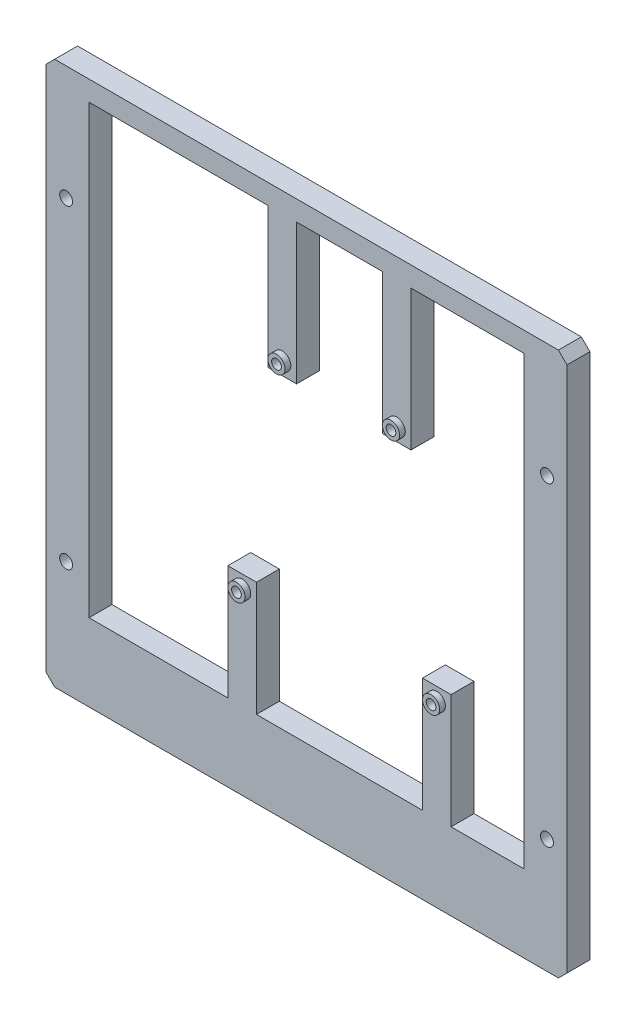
ISO-10303-21;
HEADER;
FILE_DESCRIPTION(('STEP AP214'),'2;1');
FILE_NAME('part.step','',(''),(''),'','','');
FILE_SCHEMA(('AUTOMOTIVE_DESIGN { 1 0 10303 214 1 1 1 1 }'));
ENDSEC;
DATA;
#1=APPLICATION_CONTEXT('core data for automotive mechanical design processes');
#2=APPLICATION_PROTOCOL_DEFINITION('international standard','automotive_design',2000,#1);
#3=PRODUCT_CONTEXT('',#1,'mechanical');
#4=PRODUCT('Part','Part','',(#3));
#5=PRODUCT_RELATED_PRODUCT_CATEGORY('part','',(#4));
#6=PRODUCT_DEFINITION_FORMATION('','',#4);
#7=PRODUCT_DEFINITION_CONTEXT('part definition',#1,'design');
#8=PRODUCT_DEFINITION('design','',#6,#7);
#9=PRODUCT_DEFINITION_SHAPE('','',#8);
#10=(LENGTH_UNIT() NAMED_UNIT(*) SI_UNIT(.MILLI.,.METRE.));
#11=(NAMED_UNIT(*) PLANE_ANGLE_UNIT() SI_UNIT($,.RADIAN.));
#12=(NAMED_UNIT(*) SI_UNIT($,.STERADIAN.) SOLID_ANGLE_UNIT());
#13=UNCERTAINTY_MEASURE_WITH_UNIT(LENGTH_MEASURE(1.E-05),#10,'distance_accuracy_value','');
#14=(GEOMETRIC_REPRESENTATION_CONTEXT(3) GLOBAL_UNCERTAINTY_ASSIGNED_CONTEXT((#13)) GLOBAL_UNIT_ASSIGNED_CONTEXT((#10,
#11,#12)) REPRESENTATION_CONTEXT('',''));
#15=CARTESIAN_POINT('',(0.,0.,0.));
#16=DIRECTION('',(0.,0.,1.));
#17=DIRECTION('',(1.,0.,0.));
#18=AXIS2_PLACEMENT_3D('',#15,#16,#17);
#19=CARTESIAN_POINT('',(0.,0.,8.));
#20=DIRECTION('',(0.,0.,1.));
#21=DIRECTION('',(1.,0.,0.));
#22=AXIS2_PLACEMENT_3D('',#19,#20,#21);
#23=PLANE('',#22);
#24=CARTESIAN_POINT('',(35.5,-32.5,8.));
#25=DIRECTION('',(0.,0.,1.));
#26=DIRECTION('',(1.,0.,0.));
#27=AXIS2_PLACEMENT_3D('',#24,#25,#26);
#28=CIRCLE('',#27,3.);
#29=CARTESIAN_POINT('',(38.5,-32.5,8.));
#30=VERTEX_POINT('',#29);
#31=EDGE_CURVE('E607',#30,#30,#28,.T.);
#32=ORIENTED_EDGE('',*,*,#31,.F.);
#33=EDGE_LOOP('',(#32));
#34=FACE_BOUND('',#33,.T.);
#35=CARTESIAN_POINT('',(-18.5,43.5,8.));
#36=DIRECTION('',(0.,0.,1.));
#37=DIRECTION('',(1.,0.,0.));
#38=AXIS2_PLACEMENT_3D('',#35,#36,#37);
#39=CIRCLE('',#38,3.);
#40=CARTESIAN_POINT('',(-15.5,43.5,8.));
#41=VERTEX_POINT('',#40);
#42=EDGE_CURVE('E623',#41,#41,#39,.T.);
#43=ORIENTED_EDGE('',*,*,#42,.F.);
#44=EDGE_LOOP('',(#43));
#45=FACE_BOUND('',#44,.T.);
#46=DIRECTION('',(-1.,0.,0.));
#47=VECTOR('',#46,1.);
#48=CARTESIAN_POINT('',(66.,88.,8.));
#49=LINE('',#48,#47);
#50=CARTESIAN_POINT('',(-23.5,88.,8.));
#51=VERTEX_POINT('',#50);
#52=CARTESIAN_POINT('',(-86.,88.,8.));
#53=VERTEX_POINT('',#52);
#54=EDGE_CURVE('E236',#51,#53,#49,.T.);
#55=ORIENTED_EDGE('',*,*,#54,.F.);
#56=DIRECTION('',(0.,-1.,0.));
#57=VECTOR('',#56,1.);
#58=CARTESIAN_POINT('',(-23.5,92.,8.));
#59=LINE('',#58,#57);
#60=CARTESIAN_POINT('',(-23.5,39.,8.));
#61=VERTEX_POINT('',#60);
#62=EDGE_CURVE('E229',#51,#61,#59,.T.);
#63=ORIENTED_EDGE('',*,*,#62,.T.);
#64=DIRECTION('',(1.,0.,0.));
#65=VECTOR('',#64,1.);
#66=CARTESIAN_POINT('',(-23.5,39.,8.));
#67=LINE('',#66,#65);
#68=CARTESIAN_POINT('',(-13.5,39.,8.));
#69=VERTEX_POINT('',#68);
#70=EDGE_CURVE('E233',#61,#69,#67,.T.);
#71=ORIENTED_EDGE('',*,*,#70,.T.);
#72=DIRECTION('',(0.,1.,0.));
#73=VECTOR('',#72,1.);
#74=CARTESIAN_POINT('',(-13.5,39.,8.));
#75=LINE('',#74,#73);
#76=CARTESIAN_POINT('',(-13.5,88.,8.));
#77=VERTEX_POINT('',#76);
#78=EDGE_CURVE('E247',#69,#77,#75,.T.);
#79=ORIENTED_EDGE('',*,*,#78,.T.);
#80=CARTESIAN_POINT('',(16.5,88.,8.));
#81=VERTEX_POINT('',#80);
#82=EDGE_CURVE('E371',#81,#77,#49,.T.);
#83=ORIENTED_EDGE('',*,*,#82,.F.);
#84=DIRECTION('',(0.,-1.,0.));
#85=VECTOR('',#84,1.);
#86=CARTESIAN_POINT('',(16.5,92.,8.));
#87=LINE('',#86,#85);
#88=CARTESIAN_POINT('',(16.5,39.,8.));
#89=VERTEX_POINT('',#88);
#90=EDGE_CURVE('E265',#81,#89,#87,.T.);
#91=ORIENTED_EDGE('',*,*,#90,.T.);
#92=DIRECTION('',(1.,0.,0.));
#93=VECTOR('',#92,1.);
#94=CARTESIAN_POINT('',(16.5,39.,8.));
#95=LINE('',#94,#93);
#96=CARTESIAN_POINT('',(26.5,39.,8.));
#97=VERTEX_POINT('',#96);
#98=EDGE_CURVE('E267',#89,#97,#95,.T.);
#99=ORIENTED_EDGE('',*,*,#98,.T.);
#100=DIRECTION('',(0.,1.,0.));
#101=VECTOR('',#100,1.);
#102=CARTESIAN_POINT('',(26.5,39.,8.));
#103=LINE('',#102,#101);
#104=CARTESIAN_POINT('',(26.5,88.,8.));
#105=VERTEX_POINT('',#104);
#106=EDGE_CURVE('E269',#97,#105,#103,.T.);
#107=ORIENTED_EDGE('',*,*,#106,.T.);
#108=CARTESIAN_POINT('',(66.,88.,8.));
#109=VERTEX_POINT('',#108);
#110=EDGE_CURVE('E367',#109,#105,#49,.T.);
#111=ORIENTED_EDGE('',*,*,#110,.F.);
#112=DIRECTION('',(0.,1.,0.));
#113=VECTOR('',#112,1.);
#114=CARTESIAN_POINT('',(66.,-68.,8.));
#115=LINE('',#114,#113);
#116=CARTESIAN_POINT('',(66.,-68.,8.));
#117=VERTEX_POINT('',#116);
#118=EDGE_CURVE('E363',#117,#109,#115,.T.);
#119=ORIENTED_EDGE('',*,*,#118,.F.);
#120=DIRECTION('',(1.,0.,0.));
#121=VECTOR('',#120,1.);
#122=CARTESIAN_POINT('',(-86.,-68.,8.));
#123=LINE('',#122,#121);
#124=CARTESIAN_POINT('',(40.5,-68.,8.));
#125=VERTEX_POINT('',#124);
#126=EDGE_CURVE('E358',#125,#117,#123,.T.);
#127=ORIENTED_EDGE('',*,*,#126,.F.);
#128=DIRECTION('',(0.,1.,0.));
#129=VECTOR('',#128,1.);
#130=CARTESIAN_POINT('',(40.5,-92.,8.));
#131=LINE('',#130,#129);
#132=CARTESIAN_POINT('',(40.5,-28.,8.));
#133=VERTEX_POINT('',#132);
#134=EDGE_CURVE('E288',#125,#133,#131,.T.);
#135=ORIENTED_EDGE('',*,*,#134,.T.);
#136=DIRECTION('',(-1.,0.,0.));
#137=VECTOR('',#136,1.);
#138=CARTESIAN_POINT('',(40.5,-28.,8.));
#139=LINE('',#138,#137);
#140=CARTESIAN_POINT('',(30.5,-28.,8.));
#141=VERTEX_POINT('',#140);
#142=EDGE_CURVE('E291',#133,#141,#139,.T.);
#143=ORIENTED_EDGE('',*,*,#142,.T.);
#144=DIRECTION('',(0.,-1.,0.));
#145=VECTOR('',#144,1.);
#146=CARTESIAN_POINT('',(30.5,-28.,8.));
#147=LINE('',#146,#145);
#148=CARTESIAN_POINT('',(30.5,-68.,8.));
#149=VERTEX_POINT('',#148);
#150=EDGE_CURVE('E285',#141,#149,#147,.T.);
#151=ORIENTED_EDGE('',*,*,#150,.T.);
#152=CARTESIAN_POINT('',(-27.5,-68.,8.));
#153=VERTEX_POINT('',#152);
#154=EDGE_CURVE('E364',#153,#149,#123,.T.);
#155=ORIENTED_EDGE('',*,*,#154,.F.);
#156=DIRECTION('',(0.,1.,0.));
#157=VECTOR('',#156,1.);
#158=CARTESIAN_POINT('',(-27.5,-92.,8.));
#159=LINE('',#158,#157);
#160=CARTESIAN_POINT('',(-27.5,-28.,8.));
#161=VERTEX_POINT('',#160);
#162=EDGE_CURVE('E316',#153,#161,#159,.T.);
#163=ORIENTED_EDGE('',*,*,#162,.T.);
#164=DIRECTION('',(-1.,0.,0.));
#165=VECTOR('',#164,1.);
#166=CARTESIAN_POINT('',(-27.5,-28.,8.));
#167=LINE('',#166,#165);
#168=CARTESIAN_POINT('',(-37.5,-28.,8.));
#169=VERTEX_POINT('',#168);
#170=EDGE_CURVE('E319',#161,#169,#167,.T.);
#171=ORIENTED_EDGE('',*,*,#170,.T.);
#172=DIRECTION('',(0.,-1.,0.));
#173=VECTOR('',#172,1.);
#174=CARTESIAN_POINT('',(-37.5,-28.,8.));
#175=LINE('',#174,#173);
#176=CARTESIAN_POINT('',(-37.5,-68.,8.));
#177=VERTEX_POINT('',#176);
#178=EDGE_CURVE('E313',#169,#177,#175,.T.);
#179=ORIENTED_EDGE('',*,*,#178,.T.);
#180=CARTESIAN_POINT('',(-86.,-68.,8.));
#181=VERTEX_POINT('',#180);
#182=EDGE_CURVE('E360',#181,#177,#123,.T.);
#183=ORIENTED_EDGE('',*,*,#182,.F.);
#184=DIRECTION('',(0.,-1.,0.));
#185=VECTOR('',#184,1.);
#186=CARTESIAN_POINT('',(-86.,88.,8.));
#187=LINE('',#186,#185);
#188=EDGE_CURVE('E356',#53,#181,#187,.T.);
#189=ORIENTED_EDGE('',*,*,#188,.F.);
#190=EDGE_LOOP('',(#55,#63,#71,#79,#83,#91,#99,#107,#111,#119,#127,#135,#143,#151,#155,#163,
#171,#179,#183,#189));
#191=FACE_BOUND('',#190,.T.);
#192=CARTESIAN_POINT('',(74.,-55.,8.));
#193=DIRECTION('',(0.,0.,1.));
#194=DIRECTION('',(1.,0.,0.));
#195=AXIS2_PLACEMENT_3D('',#192,#193,#194);
#196=CIRCLE('',#195,2.25);
#197=CARTESIAN_POINT('',(76.25,-55.,8.));
#198=VERTEX_POINT('',#197);
#199=EDGE_CURVE('E338',#198,#198,#196,.T.);
#200=ORIENTED_EDGE('',*,*,#199,.F.);
#201=EDGE_LOOP('',(#200));
#202=FACE_BOUND('',#201,.T.);
#203=CARTESIAN_POINT('',(-94.,-55.,8.));
#204=DIRECTION('',(0.,0.,1.));
#205=DIRECTION('',(1.,0.,0.));
#206=AXIS2_PLACEMENT_3D('',#203,#204,#205);
#207=CIRCLE('',#206,2.25);
#208=CARTESIAN_POINT('',(-91.75,-55.,8.));
#209=VERTEX_POINT('',#208);
#210=EDGE_CURVE('E350',#209,#209,#207,.T.);
#211=ORIENTED_EDGE('',*,*,#210,.F.);
#212=EDGE_LOOP('',(#211));
#213=FACE_BOUND('',#212,.T.);
#214=DIRECTION('',(0.707106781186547,-0.707106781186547,0.));
#215=VECTOR('',#214,1.);
#216=CARTESIAN_POINT('',(-101.,-92.,8.));
#217=LINE('',#216,#215);
#218=CARTESIAN_POINT('',(-101.,-92.,8.));
#219=VERTEX_POINT('',#218);
#220=CARTESIAN_POINT('',(-98.,-95.,8.));
#221=VERTEX_POINT('',#220);
#222=EDGE_CURVE('E397',#219,#221,#217,.T.);
#223=ORIENTED_EDGE('',*,*,#222,.T.);
#224=DIRECTION('',(1.,0.,0.));
#225=VECTOR('',#224,1.);
#226=CARTESIAN_POINT('',(-98.,-95.,8.));
#227=LINE('',#226,#225);
#228=CARTESIAN_POINT('',(78.,-95.,8.));
#229=VERTEX_POINT('',#228);
#230=EDGE_CURVE('E400',#221,#229,#227,.T.);
#231=ORIENTED_EDGE('',*,*,#230,.T.);
#232=DIRECTION('',(0.707106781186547,0.707106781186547,0.));
#233=VECTOR('',#232,1.);
#234=CARTESIAN_POINT('',(78.,-95.,8.));
#235=LINE('',#234,#233);
#236=CARTESIAN_POINT('',(81.,-92.,8.));
#237=VERTEX_POINT('',#236);
#238=EDGE_CURVE('E403',#229,#237,#235,.T.);
#239=ORIENTED_EDGE('',*,*,#238,.T.);
#240=DIRECTION('',(0.,1.,0.));
#241=VECTOR('',#240,1.);
#242=CARTESIAN_POINT('',(81.,-92.,8.));
#243=LINE('',#242,#241);
#244=CARTESIAN_POINT('',(81.,92.,8.));
#245=VERTEX_POINT('',#244);
#246=EDGE_CURVE('E405',#237,#245,#243,.T.);
#247=ORIENTED_EDGE('',*,*,#246,.T.);
#248=DIRECTION('',(-0.707106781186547,0.707106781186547,0.));
#249=VECTOR('',#248,1.);
#250=CARTESIAN_POINT('',(81.,92.,8.));
#251=LINE('',#250,#249);
#252=CARTESIAN_POINT('',(78.,95.,8.));
#253=VERTEX_POINT('',#252);
#254=EDGE_CURVE('E407',#245,#253,#251,.T.);
#255=ORIENTED_EDGE('',*,*,#254,.T.);
#256=DIRECTION('',(-1.,0.,0.));
#257=VECTOR('',#256,1.);
#258=CARTESIAN_POINT('',(78.,95.,8.));
#259=LINE('',#258,#257);
#260=CARTESIAN_POINT('',(-98.,95.,8.));
#261=VERTEX_POINT('',#260);
#262=EDGE_CURVE('E409',#253,#261,#259,.T.);
#263=ORIENTED_EDGE('',*,*,#262,.T.);
#264=DIRECTION('',(-0.707106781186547,-0.707106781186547,0.));
#265=VECTOR('',#264,1.);
#266=CARTESIAN_POINT('',(-98.,95.,8.));
#267=LINE('',#266,#265);
#268=CARTESIAN_POINT('',(-101.,92.,8.));
#269=VERTEX_POINT('',#268);
#270=EDGE_CURVE('E411',#261,#269,#267,.T.);
#271=ORIENTED_EDGE('',*,*,#270,.T.);
#272=DIRECTION('',(0.,-1.,0.));
#273=VECTOR('',#272,1.);
#274=CARTESIAN_POINT('',(-101.,92.,8.));
#275=LINE('',#274,#273);
#276=EDGE_CURVE('E413',#269,#219,#275,.T.);
#277=ORIENTED_EDGE('',*,*,#276,.T.);
#278=EDGE_LOOP('',(#223,#231,#239,#247,#255,#263,#271,#277));
#279=FACE_BOUND('',#278,.T.);
#280=CARTESIAN_POINT('',(-94.,55.,8.));
#281=DIRECTION('',(0.,0.,1.));
#282=DIRECTION('',(1.,0.,0.));
#283=AXIS2_PLACEMENT_3D('',#280,#281,#282);
#284=CIRCLE('',#283,2.25);
#285=CARTESIAN_POINT('',(-91.75,55.,8.));
#286=VERTEX_POINT('',#285);
#287=EDGE_CURVE('E344',#286,#286,#284,.T.);
#288=ORIENTED_EDGE('',*,*,#287,.F.);
#289=EDGE_LOOP('',(#288));
#290=FACE_BOUND('',#289,.T.);
#291=CARTESIAN_POINT('',(74.,55.,8.));
#292=DIRECTION('',(0.,0.,1.));
#293=DIRECTION('',(1.,0.,0.));
#294=AXIS2_PLACEMENT_3D('',#291,#292,#293);
#295=CIRCLE('',#294,2.25);
#296=CARTESIAN_POINT('',(76.25,55.,8.));
#297=VERTEX_POINT('',#296);
#298=EDGE_CURVE('E332',#297,#297,#295,.T.);
#299=ORIENTED_EDGE('',*,*,#298,.F.);
#300=EDGE_LOOP('',(#299));
#301=FACE_BOUND('',#300,.T.);
#302=CARTESIAN_POINT('',(21.5,43.5,8.));
#303=DIRECTION('',(0.,0.,1.));
#304=DIRECTION('',(1.,0.,0.));
#305=AXIS2_PLACEMENT_3D('',#302,#303,#304);
#306=CIRCLE('',#305,3.);
#307=CARTESIAN_POINT('',(24.5,43.5,8.));
#308=VERTEX_POINT('',#307);
#309=EDGE_CURVE('E593',#308,#308,#306,.T.);
#310=ORIENTED_EDGE('',*,*,#309,.F.);
#311=EDGE_LOOP('',(#310));
#312=FACE_BOUND('',#311,.T.);
#313=CARTESIAN_POINT('',(-32.5,-32.5,8.));
#314=DIRECTION('',(0.,0.,1.));
#315=DIRECTION('',(1.,0.,0.));
#316=AXIS2_PLACEMENT_3D('',#313,#314,#315);
#317=CIRCLE('',#316,3.);
#318=CARTESIAN_POINT('',(-29.5,-32.5,8.));
#319=VERTEX_POINT('',#318);
#320=EDGE_CURVE('E596',#319,#319,#317,.T.);
#321=ORIENTED_EDGE('',*,*,#320,.F.);
#322=EDGE_LOOP('',(#321));
#323=FACE_BOUND('',#322,.T.);
#324=ADVANCED_FACE('F43',(#34,#45,#191,#202,#213,#279,#290,#301,#312,#323),#23,.T.);
#325=CARTESIAN_POINT('',(66.,88.,8.));
#326=DIRECTION('',(0.,-1.,0.));
#327=DIRECTION('',(0.,0.,-1.));
#328=AXIS2_PLACEMENT_3D('',#325,#326,#327);
#329=PLANE('',#328);
#330=DIRECTION('',(-1.,0.,0.));
#331=VECTOR('',#330,1.);
#332=CARTESIAN_POINT('',(66.,88.,0.));
#333=LINE('',#332,#331);
#334=CARTESIAN_POINT('',(-23.5,88.,0.));
#335=VERTEX_POINT('',#334);
#336=CARTESIAN_POINT('',(-86.,88.,0.));
#337=VERTEX_POINT('',#336);
#338=EDGE_CURVE('E382',#335,#337,#333,.T.);
#339=ORIENTED_EDGE('',*,*,#338,.F.);
#340=DIRECTION('',(0.,0.,1.));
#341=VECTOR('',#340,1.);
#342=CARTESIAN_POINT('',(-23.5,88.,8.));
#343=LINE('',#342,#341);
#344=EDGE_CURVE('E255',#335,#51,#343,.T.);
#345=ORIENTED_EDGE('',*,*,#344,.T.);
#346=ORIENTED_EDGE('',*,*,#54,.T.);
#347=DIRECTION('',(0.,0.,-1.));
#348=VECTOR('',#347,1.);
#349=CARTESIAN_POINT('',(-86.,88.,8.));
#350=LINE('',#349,#348);
#351=EDGE_CURVE('E370',#53,#337,#350,.T.);
#352=ORIENTED_EDGE('',*,*,#351,.T.);
#353=EDGE_LOOP('',(#339,#345,#346,#352));
#354=FACE_BOUND('',#353,.T.);
#355=ADVANCED_FACE('F497',(#354),#329,.T.);
#356=ORIENTED_EDGE('',*,*,#82,.T.);
#357=DIRECTION('',(0.,0.,-1.));
#358=VECTOR('',#357,1.);
#359=CARTESIAN_POINT('',(-13.5,88.,8.));
#360=LINE('',#359,#358);
#361=CARTESIAN_POINT('',(-13.5,88.,0.));
#362=VERTEX_POINT('',#361);
#363=EDGE_CURVE('E253',#77,#362,#360,.T.);
#364=ORIENTED_EDGE('',*,*,#363,.T.);
#365=CARTESIAN_POINT('',(16.5,88.,0.));
#366=VERTEX_POINT('',#365);
#367=EDGE_CURVE('E385',#366,#362,#333,.T.);
#368=ORIENTED_EDGE('',*,*,#367,.F.);
#369=DIRECTION('',(0.,0.,1.));
#370=VECTOR('',#369,1.);
#371=CARTESIAN_POINT('',(16.5,88.,8.));
#372=LINE('',#371,#370);
#373=EDGE_CURVE('E11',#366,#81,#372,.T.);
#374=ORIENTED_EDGE('',*,*,#373,.T.);
#375=EDGE_LOOP('',(#356,#364,#368,#374));
#376=FACE_BOUND('',#375,.T.);
#377=ADVANCED_FACE('F488',(#376),#329,.T.);
#378=ORIENTED_EDGE('',*,*,#110,.T.);
#379=DIRECTION('',(0.,0.,-1.));
#380=VECTOR('',#379,1.);
#381=CARTESIAN_POINT('',(26.5,88.,8.));
#382=LINE('',#381,#380);
#383=CARTESIAN_POINT('',(26.5,88.,0.));
#384=VERTEX_POINT('',#383);
#385=EDGE_CURVE('E51',#105,#384,#382,.T.);
#386=ORIENTED_EDGE('',*,*,#385,.T.);
#387=CARTESIAN_POINT('',(66.,88.,0.));
#388=VERTEX_POINT('',#387);
#389=EDGE_CURVE('E359',#388,#384,#333,.T.);
#390=ORIENTED_EDGE('',*,*,#389,.F.);
#391=DIRECTION('',(0.,0.,-1.));
#392=VECTOR('',#391,1.);
#393=CARTESIAN_POINT('',(66.,88.,8.));
#394=LINE('',#393,#392);
#395=EDGE_CURVE('E388',#109,#388,#394,.T.);
#396=ORIENTED_EDGE('',*,*,#395,.F.);
#397=EDGE_LOOP('',(#378,#386,#390,#396));
#398=FACE_BOUND('',#397,.T.);
#399=ADVANCED_FACE('F461',(#398),#329,.T.);
#400=CARTESIAN_POINT('',(-86.,-68.,8.));
#401=DIRECTION('',(0.,1.,0.));
#402=DIRECTION('',(0.,0.,1.));
#403=AXIS2_PLACEMENT_3D('',#400,#401,#402);
#404=PLANE('',#403);
#405=ORIENTED_EDGE('',*,*,#154,.T.);
#406=DIRECTION('',(0.,0.,-1.));
#407=VECTOR('',#406,1.);
#408=CARTESIAN_POINT('',(30.5,-68.,8.));
#409=LINE('',#408,#407);
#410=CARTESIAN_POINT('',(30.5,-68.,0.));
#411=VERTEX_POINT('',#410);
#412=EDGE_CURVE('E306',#149,#411,#409,.T.);
#413=ORIENTED_EDGE('',*,*,#412,.T.);
#414=DIRECTION('',(1.,0.,0.));
#415=VECTOR('',#414,1.);
#416=CARTESIAN_POINT('',(-86.,-68.,0.));
#417=LINE('',#416,#415);
#418=CARTESIAN_POINT('',(-27.5,-68.,0.));
#419=VERTEX_POINT('',#418);
#420=EDGE_CURVE('E379',#419,#411,#417,.T.);
#421=ORIENTED_EDGE('',*,*,#420,.F.);
#422=DIRECTION('',(0.,0.,1.));
#423=VECTOR('',#422,1.);
#424=CARTESIAN_POINT('',(-27.5,-68.,8.));
#425=LINE('',#424,#423);
#426=EDGE_CURVE('E454',#419,#153,#425,.T.);
#427=ORIENTED_EDGE('',*,*,#426,.T.);
#428=EDGE_LOOP('',(#405,#413,#421,#427));
#429=FACE_BOUND('',#428,.T.);
#430=ADVANCED_FACE('F722',(#429),#404,.T.);
#431=CARTESIAN_POINT('',(40.5,-68.,0.));
#432=VERTEX_POINT('',#431);
#433=CARTESIAN_POINT('',(66.,-68.,0.));
#434=VERTEX_POINT('',#433);
#435=EDGE_CURVE('E374',#432,#434,#417,.T.);
#436=ORIENTED_EDGE('',*,*,#435,.F.);
#437=DIRECTION('',(0.,0.,1.));
#438=VECTOR('',#437,1.);
#439=CARTESIAN_POINT('',(40.5,-68.,8.));
#440=LINE('',#439,#438);
#441=EDGE_CURVE('E303',#432,#125,#440,.T.);
#442=ORIENTED_EDGE('',*,*,#441,.T.);
#443=ORIENTED_EDGE('',*,*,#126,.T.);
#444=DIRECTION('',(0.,0.,-1.));
#445=VECTOR('',#444,1.);
#446=CARTESIAN_POINT('',(66.,-68.,8.));
#447=LINE('',#446,#445);
#448=EDGE_CURVE('E390',#117,#434,#447,.T.);
#449=ORIENTED_EDGE('',*,*,#448,.T.);
#450=EDGE_LOOP('',(#436,#442,#443,#449));
#451=FACE_BOUND('',#450,.T.);
#452=ADVANCED_FACE('F720',(#451),#404,.T.);
#453=ORIENTED_EDGE('',*,*,#182,.T.);
#454=DIRECTION('',(0.,0.,-1.));
#455=VECTOR('',#454,1.);
#456=CARTESIAN_POINT('',(-37.5,-68.,8.));
#457=LINE('',#456,#455);
#458=CARTESIAN_POINT('',(-37.5,-68.,0.));
#459=VERTEX_POINT('',#458);
#460=EDGE_CURVE('E457',#177,#459,#457,.T.);
#461=ORIENTED_EDGE('',*,*,#460,.T.);
#462=CARTESIAN_POINT('',(-86.,-68.,0.));
#463=VERTEX_POINT('',#462);
#464=EDGE_CURVE('E375',#463,#459,#417,.T.);
#465=ORIENTED_EDGE('',*,*,#464,.F.);
#466=DIRECTION('',(0.,0.,-1.));
#467=VECTOR('',#466,1.);
#468=CARTESIAN_POINT('',(-86.,-68.,8.));
#469=LINE('',#468,#467);
#470=EDGE_CURVE('E393',#181,#463,#469,.T.);
#471=ORIENTED_EDGE('',*,*,#470,.F.);
#472=EDGE_LOOP('',(#453,#461,#465,#471));
#473=FACE_BOUND('',#472,.T.);
#474=ADVANCED_FACE('F530',(#473),#404,.T.);
#475=CARTESIAN_POINT('',(0.,0.,0.));
#476=DIRECTION('',(0.,0.,1.));
#477=DIRECTION('',(1.,0.,0.));
#478=AXIS2_PLACEMENT_3D('',#475,#476,#477);
#479=PLANE('',#478);
#480=ORIENTED_EDGE('',*,*,#367,.T.);
#481=DIRECTION('',(0.,1.,0.));
#482=VECTOR('',#481,1.);
#483=CARTESIAN_POINT('',(-13.5,39.,0.));
#484=LINE('',#483,#482);
#485=CARTESIAN_POINT('',(-13.5,39.,0.));
#486=VERTEX_POINT('',#485);
#487=EDGE_CURVE('E58',#486,#362,#484,.T.);
#488=ORIENTED_EDGE('',*,*,#487,.F.);
#489=DIRECTION('',(1.,0.,0.));
#490=VECTOR('',#489,1.);
#491=CARTESIAN_POINT('',(-23.5,39.,0.));
#492=LINE('',#491,#490);
#493=CARTESIAN_POINT('',(-23.5,39.,0.));
#494=VERTEX_POINT('',#493);
#495=EDGE_CURVE('E501',#494,#486,#492,.T.);
#496=ORIENTED_EDGE('',*,*,#495,.F.);
#497=DIRECTION('',(0.,-1.,0.));
#498=VECTOR('',#497,1.);
#499=CARTESIAN_POINT('',(-23.5,92.,0.));
#500=LINE('',#499,#498);
#501=EDGE_CURVE('E251',#335,#494,#500,.T.);
#502=ORIENTED_EDGE('',*,*,#501,.F.);
#503=ORIENTED_EDGE('',*,*,#338,.T.);
#504=DIRECTION('',(0.,-1.,0.));
#505=VECTOR('',#504,1.);
#506=CARTESIAN_POINT('',(-86.,88.,0.));
#507=LINE('',#506,#505);
#508=EDGE_CURVE('E353',#337,#463,#507,.T.);
#509=ORIENTED_EDGE('',*,*,#508,.T.);
#510=ORIENTED_EDGE('',*,*,#464,.T.);
#511=DIRECTION('',(0.,-1.,0.));
#512=VECTOR('',#511,1.);
#513=CARTESIAN_POINT('',(-37.5,-28.,0.));
#514=LINE('',#513,#512);
#515=CARTESIAN_POINT('',(-37.5,-28.,0.));
#516=VERTEX_POINT('',#515);
#517=EDGE_CURVE('E312',#516,#459,#514,.T.);
#518=ORIENTED_EDGE('',*,*,#517,.F.);
#519=DIRECTION('',(-1.,0.,0.));
#520=VECTOR('',#519,1.);
#521=CARTESIAN_POINT('',(-27.5,-28.,0.));
#522=LINE('',#521,#520);
#523=CARTESIAN_POINT('',(-27.5,-28.,0.));
#524=VERTEX_POINT('',#523);
#525=EDGE_CURVE('E317',#524,#516,#522,.T.);
#526=ORIENTED_EDGE('',*,*,#525,.F.);
#527=DIRECTION('',(0.,1.,0.));
#528=VECTOR('',#527,1.);
#529=CARTESIAN_POINT('',(-27.5,-92.,0.));
#530=LINE('',#529,#528);
#531=EDGE_CURVE('E323',#419,#524,#530,.T.);
#532=ORIENTED_EDGE('',*,*,#531,.F.);
#533=ORIENTED_EDGE('',*,*,#420,.T.);
#534=DIRECTION('',(0.,-1.,0.));
#535=VECTOR('',#534,1.);
#536=CARTESIAN_POINT('',(30.5,-28.,0.));
#537=LINE('',#536,#535);
#538=CARTESIAN_POINT('',(30.5,-28.,0.));
#539=VERTEX_POINT('',#538);
#540=EDGE_CURVE('E284',#539,#411,#537,.T.);
#541=ORIENTED_EDGE('',*,*,#540,.F.);
#542=DIRECTION('',(-1.,0.,0.));
#543=VECTOR('',#542,1.);
#544=CARTESIAN_POINT('',(40.5,-28.,0.));
#545=LINE('',#544,#543);
#546=CARTESIAN_POINT('',(40.5,-28.,0.));
#547=VERTEX_POINT('',#546);
#548=EDGE_CURVE('E289',#547,#539,#545,.T.);
#549=ORIENTED_EDGE('',*,*,#548,.F.);
#550=DIRECTION('',(0.,1.,0.));
#551=VECTOR('',#550,1.);
#552=CARTESIAN_POINT('',(40.5,-92.,0.));
#553=LINE('',#552,#551);
#554=EDGE_CURVE('E295',#432,#547,#553,.T.);
#555=ORIENTED_EDGE('',*,*,#554,.F.);
#556=ORIENTED_EDGE('',*,*,#435,.T.);
#557=DIRECTION('',(0.,1.,0.));
#558=VECTOR('',#557,1.);
#559=CARTESIAN_POINT('',(66.,-68.,0.));
#560=LINE('',#559,#558);
#561=EDGE_CURVE('E378',#434,#388,#560,.T.);
#562=ORIENTED_EDGE('',*,*,#561,.T.);
#563=ORIENTED_EDGE('',*,*,#389,.T.);
#564=DIRECTION('',(0.,1.,0.));
#565=VECTOR('',#564,1.);
#566=CARTESIAN_POINT('',(26.5,39.,0.));
#567=LINE('',#566,#565);
#568=CARTESIAN_POINT('',(26.5,39.,0.));
#569=VERTEX_POINT('',#568);
#570=EDGE_CURVE('E66',#569,#384,#567,.T.);
#571=ORIENTED_EDGE('',*,*,#570,.F.);
#572=DIRECTION('',(1.,0.,0.));
#573=VECTOR('',#572,1.);
#574=CARTESIAN_POINT('',(16.5,39.,0.));
#575=LINE('',#574,#573);
#576=CARTESIAN_POINT('',(16.5,39.,0.));
#577=VERTEX_POINT('',#576);
#578=EDGE_CURVE('E274',#577,#569,#575,.T.);
#579=ORIENTED_EDGE('',*,*,#578,.F.);
#580=DIRECTION('',(0.,-1.,0.));
#581=VECTOR('',#580,1.);
#582=CARTESIAN_POINT('',(16.5,92.,0.));
#583=LINE('',#582,#581);
#584=EDGE_CURVE('E264',#366,#577,#583,.T.);
#585=ORIENTED_EDGE('',*,*,#584,.F.);
#586=EDGE_LOOP('',(#480,#488,#496,#502,#503,#509,#510,#518,#526,#532,#533,#541,#549,#555,#556,
#562,#563,#571,#579,#585));
#587=FACE_BOUND('',#586,.T.);
#588=DIRECTION('',(0.707106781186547,-0.707106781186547,0.));
#589=VECTOR('',#588,1.);
#590=CARTESIAN_POINT('',(-101.,-92.,0.));
#591=LINE('',#590,#589);
#592=CARTESIAN_POINT('',(-101.,-92.,0.));
#593=VERTEX_POINT('',#592);
#594=CARTESIAN_POINT('',(-98.,-95.,0.));
#595=VERTEX_POINT('',#594);
#596=EDGE_CURVE('E396',#593,#595,#591,.T.);
#597=ORIENTED_EDGE('',*,*,#596,.F.);
#598=DIRECTION('',(0.,-1.,0.));
#599=VECTOR('',#598,1.);
#600=CARTESIAN_POINT('',(-101.,92.,0.));
#601=LINE('',#600,#599);
#602=CARTESIAN_POINT('',(-101.,92.,0.));
#603=VERTEX_POINT('',#602);
#604=EDGE_CURVE('E401',#603,#593,#601,.T.);
#605=ORIENTED_EDGE('',*,*,#604,.F.);
#606=DIRECTION('',(-0.707106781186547,-0.707106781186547,0.));
#607=VECTOR('',#606,1.);
#608=CARTESIAN_POINT('',(-98.,95.,0.));
#609=LINE('',#608,#607);
#610=CARTESIAN_POINT('',(-98.,95.,0.));
#611=VERTEX_POINT('',#610);
#612=EDGE_CURVE('E428',#611,#603,#609,.T.);
#613=ORIENTED_EDGE('',*,*,#612,.F.);
#614=DIRECTION('',(-1.,0.,0.));
#615=VECTOR('',#614,1.);
#616=CARTESIAN_POINT('',(78.,95.,0.));
#617=LINE('',#616,#615);
#618=CARTESIAN_POINT('',(78.,95.,0.));
#619=VERTEX_POINT('',#618);
#620=EDGE_CURVE('E426',#619,#611,#617,.T.);
#621=ORIENTED_EDGE('',*,*,#620,.F.);
#622=DIRECTION('',(-0.707106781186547,0.707106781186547,0.));
#623=VECTOR('',#622,1.);
#624=CARTESIAN_POINT('',(81.,92.,0.));
#625=LINE('',#624,#623);
#626=CARTESIAN_POINT('',(81.,92.,0.));
#627=VERTEX_POINT('',#626);
#628=EDGE_CURVE('E424',#627,#619,#625,.T.);
#629=ORIENTED_EDGE('',*,*,#628,.F.);
#630=DIRECTION('',(0.,1.,0.));
#631=VECTOR('',#630,1.);
#632=CARTESIAN_POINT('',(81.,-92.,0.));
#633=LINE('',#632,#631);
#634=CARTESIAN_POINT('',(81.,-92.,0.));
#635=VERTEX_POINT('',#634);
#636=EDGE_CURVE('E422',#635,#627,#633,.T.);
#637=ORIENTED_EDGE('',*,*,#636,.F.);
#638=DIRECTION('',(0.707106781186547,0.707106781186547,0.));
#639=VECTOR('',#638,1.);
#640=CARTESIAN_POINT('',(78.,-95.,0.));
#641=LINE('',#640,#639);
#642=CARTESIAN_POINT('',(78.,-95.,0.));
#643=VERTEX_POINT('',#642);
#644=EDGE_CURVE('E420',#643,#635,#641,.T.);
#645=ORIENTED_EDGE('',*,*,#644,.F.);
#646=DIRECTION('',(1.,0.,0.));
#647=VECTOR('',#646,1.);
#648=CARTESIAN_POINT('',(-98.,-95.,0.));
#649=LINE('',#648,#647);
#650=EDGE_CURVE('E418',#595,#643,#649,.T.);
#651=ORIENTED_EDGE('',*,*,#650,.F.);
#652=EDGE_LOOP('',(#597,#605,#613,#621,#629,#637,#645,#651));
#653=FACE_BOUND('',#652,.T.);
#654=CARTESIAN_POINT('',(-94.,-55.,0.));
#655=DIRECTION('',(0.,0.,1.));
#656=DIRECTION('',(1.,0.,0.));
#657=AXIS2_PLACEMENT_3D('',#654,#655,#656);
#658=CIRCLE('',#657,2.25);
#659=CARTESIAN_POINT('',(-91.75,-55.,0.));
#660=VERTEX_POINT('',#659);
#661=EDGE_CURVE('E347',#660,#660,#658,.T.);
#662=ORIENTED_EDGE('',*,*,#661,.T.);
#663=EDGE_LOOP('',(#662));
#664=FACE_BOUND('',#663,.T.);
#665=CARTESIAN_POINT('',(-94.,55.,0.));
#666=DIRECTION('',(0.,0.,1.));
#667=DIRECTION('',(1.,0.,0.));
#668=AXIS2_PLACEMENT_3D('',#665,#666,#667);
#669=CIRCLE('',#668,2.25);
#670=CARTESIAN_POINT('',(-91.75,55.,0.));
#671=VERTEX_POINT('',#670);
#672=EDGE_CURVE('E341',#671,#671,#669,.T.);
#673=ORIENTED_EDGE('',*,*,#672,.T.);
#674=EDGE_LOOP('',(#673));
#675=FACE_BOUND('',#674,.T.);
#676=CARTESIAN_POINT('',(74.,-55.,0.));
#677=DIRECTION('',(0.,0.,1.));
#678=DIRECTION('',(1.,0.,0.));
#679=AXIS2_PLACEMENT_3D('',#676,#677,#678);
#680=CIRCLE('',#679,2.25);
#681=CARTESIAN_POINT('',(76.25,-55.,0.));
#682=VERTEX_POINT('',#681);
#683=EDGE_CURVE('E335',#682,#682,#680,.T.);
#684=ORIENTED_EDGE('',*,*,#683,.T.);
#685=EDGE_LOOP('',(#684));
#686=FACE_BOUND('',#685,.T.);
#687=CARTESIAN_POINT('',(74.,55.,0.));
#688=DIRECTION('',(0.,0.,1.));
#689=DIRECTION('',(1.,0.,0.));
#690=AXIS2_PLACEMENT_3D('',#687,#688,#689);
#691=CIRCLE('',#690,2.25);
#692=CARTESIAN_POINT('',(76.25,55.,0.));
#693=VERTEX_POINT('',#692);
#694=EDGE_CURVE('E331',#693,#693,#691,.T.);
#695=ORIENTED_EDGE('',*,*,#694,.T.);
#696=EDGE_LOOP('',(#695));
#697=FACE_BOUND('',#696,.T.);
#698=CARTESIAN_POINT('',(-32.5,-32.5,0.));
#699=DIRECTION('',(0.,0.,1.));
#700=DIRECTION('',(1.,0.,0.));
#701=AXIS2_PLACEMENT_3D('',#698,#699,#700);
#702=CIRCLE('',#701,1.7);
#703=CARTESIAN_POINT('',(-30.8,-32.5,0.));
#704=VERTEX_POINT('',#703);
#705=EDGE_CURVE('E309',#704,#704,#702,.T.);
#706=ORIENTED_EDGE('',*,*,#705,.T.);
#707=EDGE_LOOP('',(#706));
#708=FACE_BOUND('',#707,.T.);
#709=CARTESIAN_POINT('',(35.5,-32.5,0.));
#710=DIRECTION('',(0.,0.,1.));
#711=DIRECTION('',(1.,0.,0.));
#712=AXIS2_PLACEMENT_3D('',#709,#710,#711);
#713=CIRCLE('',#712,1.7);
#714=CARTESIAN_POINT('',(37.2,-32.5,0.));
#715=VERTEX_POINT('',#714);
#716=EDGE_CURVE('E281',#715,#715,#713,.T.);
#717=ORIENTED_EDGE('',*,*,#716,.T.);
#718=EDGE_LOOP('',(#717));
#719=FACE_BOUND('',#718,.T.);
#720=CARTESIAN_POINT('',(21.5,43.5,0.));
#721=DIRECTION('',(0.,0.,1.));
#722=DIRECTION('',(1.,0.,0.));
#723=AXIS2_PLACEMENT_3D('',#720,#721,#722);
#724=CIRCLE('',#723,1.7);
#725=CARTESIAN_POINT('',(23.2,43.5,0.));
#726=VERTEX_POINT('',#725);
#727=EDGE_CURVE('E261',#726,#726,#724,.T.);
#728=ORIENTED_EDGE('',*,*,#727,.T.);
#729=EDGE_LOOP('',(#728));
#730=FACE_BOUND('',#729,.T.);
#731=CARTESIAN_POINT('',(-18.5,43.5,0.));
#732=DIRECTION('',(0.,0.,1.));
#733=DIRECTION('',(1.,0.,0.));
#734=AXIS2_PLACEMENT_3D('',#731,#732,#733);
#735=CIRCLE('',#734,1.7);
#736=CARTESIAN_POINT('',(-16.8,43.5,0.));
#737=VERTEX_POINT('',#736);
#738=EDGE_CURVE('E502',#737,#737,#735,.T.);
#739=ORIENTED_EDGE('',*,*,#738,.T.);
#740=EDGE_LOOP('',(#739));
#741=FACE_BOUND('',#740,.T.);
#742=ADVANCED_FACE('F466',(#587,#653,#664,#675,#686,#697,#708,#719,#730,#741),#479,.F.);
#743=CARTESIAN_POINT('',(-101.,-92.,8.));
#744=DIRECTION('',(0.707106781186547,0.707106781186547,0.));
#745=DIRECTION('',(-0.707106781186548,0.707106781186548,0.));
#746=AXIS2_PLACEMENT_3D('',#743,#744,#745);
#747=PLANE('',#746);
#748=ORIENTED_EDGE('',*,*,#596,.T.);
#749=DIRECTION('',(0.,0.,-1.));
#750=VECTOR('',#749,1.);
#751=CARTESIAN_POINT('',(-98.,-95.,8.));
#752=LINE('',#751,#750);
#753=EDGE_CURVE('E451',#221,#595,#752,.T.);
#754=ORIENTED_EDGE('',*,*,#753,.F.);
#755=ORIENTED_EDGE('',*,*,#222,.F.);
#756=DIRECTION('',(0.,0.,-1.));
#757=VECTOR('',#756,1.);
#758=CARTESIAN_POINT('',(-101.,-92.,8.));
#759=LINE('',#758,#757);
#760=EDGE_CURVE('E415',#219,#593,#759,.T.);
#761=ORIENTED_EDGE('',*,*,#760,.T.);
#762=EDGE_LOOP('',(#748,#754,#755,#761));
#763=FACE_BOUND('',#762,.T.);
#764=ADVANCED_FACE('F45',(#763),#747,.F.);
#765=CARTESIAN_POINT('',(-98.,-95.,8.));
#766=DIRECTION('',(0.,1.,0.));
#767=DIRECTION('',(0.,0.,1.));
#768=AXIS2_PLACEMENT_3D('',#765,#766,#767);
#769=PLANE('',#768);
#770=ORIENTED_EDGE('',*,*,#650,.T.);
#771=DIRECTION('',(0.,0.,-1.));
#772=VECTOR('',#771,1.);
#773=CARTESIAN_POINT('',(78.,-95.,8.));
#774=LINE('',#773,#772);
#775=EDGE_CURVE('E448',#229,#643,#774,.T.);
#776=ORIENTED_EDGE('',*,*,#775,.F.);
#777=ORIENTED_EDGE('',*,*,#230,.F.);
#778=ORIENTED_EDGE('',*,*,#753,.T.);
#779=EDGE_LOOP('',(#770,#776,#777,#778));
#780=FACE_BOUND('',#779,.T.);
#781=ADVANCED_FACE('F553',(#780),#769,.F.);
#782=CARTESIAN_POINT('',(78.,-95.,8.));
#783=DIRECTION('',(-0.707106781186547,0.707106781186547,0.));
#784=DIRECTION('',(-0.707106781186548,-0.707106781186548,0.));
#785=AXIS2_PLACEMENT_3D('',#782,#783,#784);
#786=PLANE('',#785);
#787=ORIENTED_EDGE('',*,*,#644,.T.);
#788=DIRECTION('',(0.,0.,-1.));
#789=VECTOR('',#788,1.);
#790=CARTESIAN_POINT('',(81.,-92.,8.));
#791=LINE('',#790,#789);
#792=EDGE_CURVE('E445',#237,#635,#791,.T.);
#793=ORIENTED_EDGE('',*,*,#792,.F.);
#794=ORIENTED_EDGE('',*,*,#238,.F.);
#795=ORIENTED_EDGE('',*,*,#775,.T.);
#796=EDGE_LOOP('',(#787,#793,#794,#795));
#797=FACE_BOUND('',#796,.T.);
#798=ADVANCED_FACE('F550',(#797),#786,.F.);
#799=CARTESIAN_POINT('',(81.,-92.,8.));
#800=DIRECTION('',(-1.,0.,0.));
#801=DIRECTION('',(0.,0.,1.));
#802=AXIS2_PLACEMENT_3D('',#799,#800,#801);
#803=PLANE('',#802);
#804=ORIENTED_EDGE('',*,*,#636,.T.);
#805=DIRECTION('',(0.,0.,-1.));
#806=VECTOR('',#805,1.);
#807=CARTESIAN_POINT('',(81.,92.,8.));
#808=LINE('',#807,#806);
#809=EDGE_CURVE('E442',#245,#627,#808,.T.);
#810=ORIENTED_EDGE('',*,*,#809,.F.);
#811=ORIENTED_EDGE('',*,*,#246,.F.);
#812=ORIENTED_EDGE('',*,*,#792,.T.);
#813=EDGE_LOOP('',(#804,#810,#811,#812));
#814=FACE_BOUND('',#813,.T.);
#815=ADVANCED_FACE('F546',(#814),#803,.F.);
#816=CARTESIAN_POINT('',(81.,92.,8.));
#817=DIRECTION('',(-0.707106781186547,-0.707106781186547,0.));
#818=DIRECTION('',(0.707106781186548,-0.707106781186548,0.));
#819=AXIS2_PLACEMENT_3D('',#816,#817,#818);
#820=PLANE('',#819);
#821=ORIENTED_EDGE('',*,*,#628,.T.);
#822=DIRECTION('',(0.,0.,-1.));
#823=VECTOR('',#822,1.);
#824=CARTESIAN_POINT('',(78.,95.,8.));
#825=LINE('',#824,#823);
#826=EDGE_CURVE('E439',#253,#619,#825,.T.);
#827=ORIENTED_EDGE('',*,*,#826,.F.);
#828=ORIENTED_EDGE('',*,*,#254,.F.);
#829=ORIENTED_EDGE('',*,*,#809,.T.);
#830=EDGE_LOOP('',(#821,#827,#828,#829));
#831=FACE_BOUND('',#830,.T.);
#832=ADVANCED_FACE('F542',(#831),#820,.F.);
#833=CARTESIAN_POINT('',(78.,95.,8.));
#834=DIRECTION('',(0.,-1.,0.));
#835=DIRECTION('',(0.,0.,-1.));
#836=AXIS2_PLACEMENT_3D('',#833,#834,#835);
#837=PLANE('',#836);
#838=ORIENTED_EDGE('',*,*,#620,.T.);
#839=DIRECTION('',(0.,0.,-1.));
#840=VECTOR('',#839,1.);
#841=CARTESIAN_POINT('',(-98.,95.,8.));
#842=LINE('',#841,#840);
#843=EDGE_CURVE('E436',#261,#611,#842,.T.);
#844=ORIENTED_EDGE('',*,*,#843,.F.);
#845=ORIENTED_EDGE('',*,*,#262,.F.);
#846=ORIENTED_EDGE('',*,*,#826,.T.);
#847=EDGE_LOOP('',(#838,#844,#845,#846));
#848=FACE_BOUND('',#847,.T.);
#849=ADVANCED_FACE('F538',(#848),#837,.F.);
#850=CARTESIAN_POINT('',(-98.,95.,8.));
#851=DIRECTION('',(0.707106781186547,-0.707106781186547,0.));
#852=DIRECTION('',(0.707106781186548,0.707106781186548,0.));
#853=AXIS2_PLACEMENT_3D('',#850,#851,#852);
#854=PLANE('',#853);
#855=ORIENTED_EDGE('',*,*,#612,.T.);
#856=DIRECTION('',(0.,0.,-1.));
#857=VECTOR('',#856,1.);
#858=CARTESIAN_POINT('',(-101.,92.,8.));
#859=LINE('',#858,#857);
#860=EDGE_CURVE('E433',#269,#603,#859,.T.);
#861=ORIENTED_EDGE('',*,*,#860,.F.);
#862=ORIENTED_EDGE('',*,*,#270,.F.);
#863=ORIENTED_EDGE('',*,*,#843,.T.);
#864=EDGE_LOOP('',(#855,#861,#862,#863));
#865=FACE_BOUND('',#864,.T.);
#866=ADVANCED_FACE('F534',(#865),#854,.F.);
#867=CARTESIAN_POINT('',(-101.,92.,8.));
#868=DIRECTION('',(1.,0.,0.));
#869=DIRECTION('',(0.,0.,-1.));
#870=AXIS2_PLACEMENT_3D('',#867,#868,#869);
#871=PLANE('',#870);
#872=ORIENTED_EDGE('',*,*,#604,.T.);
#873=ORIENTED_EDGE('',*,*,#760,.F.);
#874=ORIENTED_EDGE('',*,*,#276,.F.);
#875=ORIENTED_EDGE('',*,*,#860,.T.);
#876=EDGE_LOOP('',(#872,#873,#874,#875));
#877=FACE_BOUND('',#876,.T.);
#878=ADVANCED_FACE('F531',(#877),#871,.F.);
#879=CARTESIAN_POINT('',(-86.,88.,8.));
#880=DIRECTION('',(1.,0.,0.));
#881=DIRECTION('',(0.,0.,-1.));
#882=AXIS2_PLACEMENT_3D('',#879,#880,#881);
#883=PLANE('',#882);
#884=ORIENTED_EDGE('',*,*,#508,.F.);
#885=ORIENTED_EDGE('',*,*,#351,.F.);
#886=ORIENTED_EDGE('',*,*,#188,.T.);
#887=ORIENTED_EDGE('',*,*,#470,.T.);
#888=EDGE_LOOP('',(#884,#885,#886,#887));
#889=FACE_BOUND('',#888,.T.);
#890=ADVANCED_FACE('F495',(#889),#883,.T.);
#891=CARTESIAN_POINT('',(66.,-68.,8.));
#892=DIRECTION('',(-1.,0.,0.));
#893=DIRECTION('',(0.,0.,1.));
#894=AXIS2_PLACEMENT_3D('',#891,#892,#893);
#895=PLANE('',#894);
#896=ORIENTED_EDGE('',*,*,#561,.F.);
#897=ORIENTED_EDGE('',*,*,#448,.F.);
#898=ORIENTED_EDGE('',*,*,#118,.T.);
#899=ORIENTED_EDGE('',*,*,#395,.T.);
#900=EDGE_LOOP('',(#896,#897,#898,#899));
#901=FACE_BOUND('',#900,.T.);
#902=ADVANCED_FACE('F474',(#901),#895,.T.);
#903=CARTESIAN_POINT('',(-94.,-55.,8.));
#904=DIRECTION('',(0.,0.,-1.));
#905=DIRECTION('',(-1.,0.,0.));
#906=AXIS2_PLACEMENT_3D('',#903,#904,#905);
#907=CYLINDRICAL_SURFACE('',#906,2.25);
#908=ORIENTED_EDGE('',*,*,#210,.T.);
#909=EDGE_LOOP('',(#908));
#910=FACE_BOUND('',#909,.T.);
#911=ORIENTED_EDGE('',*,*,#661,.F.);
#912=EDGE_LOOP('',(#911));
#913=FACE_BOUND('',#912,.T.);
#914=ADVANCED_FACE('F713',(#910,#913),#907,.F.);
#915=CARTESIAN_POINT('',(-94.,55.,8.));
#916=DIRECTION('',(0.,0.,-1.));
#917=DIRECTION('',(-1.,0.,0.));
#918=AXIS2_PLACEMENT_3D('',#915,#916,#917);
#919=CYLINDRICAL_SURFACE('',#918,2.25);
#920=ORIENTED_EDGE('',*,*,#287,.T.);
#921=EDGE_LOOP('',(#920));
#922=FACE_BOUND('',#921,.T.);
#923=ORIENTED_EDGE('',*,*,#672,.F.);
#924=EDGE_LOOP('',(#923));
#925=FACE_BOUND('',#924,.T.);
#926=ADVANCED_FACE('F709',(#922,#925),#919,.F.);
#927=CARTESIAN_POINT('',(74.,-55.,8.));
#928=DIRECTION('',(0.,0.,-1.));
#929=DIRECTION('',(-1.,0.,0.));
#930=AXIS2_PLACEMENT_3D('',#927,#928,#929);
#931=CYLINDRICAL_SURFACE('',#930,2.25);
#932=ORIENTED_EDGE('',*,*,#199,.T.);
#933=EDGE_LOOP('',(#932));
#934=FACE_BOUND('',#933,.T.);
#935=ORIENTED_EDGE('',*,*,#683,.F.);
#936=EDGE_LOOP('',(#935));
#937=FACE_BOUND('',#936,.T.);
#938=ADVANCED_FACE('F705',(#934,#937),#931,.F.);
#939=CARTESIAN_POINT('',(74.,55.,8.));
#940=DIRECTION('',(0.,0.,-1.));
#941=DIRECTION('',(-1.,0.,0.));
#942=AXIS2_PLACEMENT_3D('',#939,#940,#941);
#943=CYLINDRICAL_SURFACE('',#942,2.25);
#944=ORIENTED_EDGE('',*,*,#298,.T.);
#945=EDGE_LOOP('',(#944));
#946=FACE_BOUND('',#945,.T.);
#947=ORIENTED_EDGE('',*,*,#694,.F.);
#948=EDGE_LOOP('',(#947));
#949=FACE_BOUND('',#948,.T.);
#950=ADVANCED_FACE('F701',(#946,#949),#943,.F.);
#951=CARTESIAN_POINT('',(-37.5,-28.,8.));
#952=DIRECTION('',(1.,0.,0.));
#953=DIRECTION('',(0.,0.,-1.));
#954=AXIS2_PLACEMENT_3D('',#951,#952,#953);
#955=PLANE('',#954);
#956=ORIENTED_EDGE('',*,*,#460,.F.);
#957=ORIENTED_EDGE('',*,*,#178,.F.);
#958=DIRECTION('',(0.,0.,-1.));
#959=VECTOR('',#958,1.);
#960=CARTESIAN_POINT('',(-37.5,-28.,8.));
#961=LINE('',#960,#959);
#962=EDGE_CURVE('E321',#169,#516,#961,.T.);
#963=ORIENTED_EDGE('',*,*,#962,.T.);
#964=ORIENTED_EDGE('',*,*,#517,.T.);
#965=EDGE_LOOP('',(#956,#957,#963,#964));
#966=FACE_BOUND('',#965,.T.);
#967=ADVANCED_FACE('F697',(#966),#955,.F.);
#968=CARTESIAN_POINT('',(-27.5,-92.,8.));
#969=DIRECTION('',(-1.,0.,0.));
#970=DIRECTION('',(0.,0.,1.));
#971=AXIS2_PLACEMENT_3D('',#968,#969,#970);
#972=PLANE('',#971);
#973=ORIENTED_EDGE('',*,*,#426,.F.);
#974=ORIENTED_EDGE('',*,*,#531,.T.);
#975=DIRECTION('',(0.,0.,-1.));
#976=VECTOR('',#975,1.);
#977=CARTESIAN_POINT('',(-27.5,-28.,8.));
#978=LINE('',#977,#976);
#979=EDGE_CURVE('E328',#161,#524,#978,.T.);
#980=ORIENTED_EDGE('',*,*,#979,.F.);
#981=ORIENTED_EDGE('',*,*,#162,.F.);
#982=EDGE_LOOP('',(#973,#974,#980,#981));
#983=FACE_BOUND('',#982,.T.);
#984=ADVANCED_FACE('F689',(#983),#972,.F.);
#985=CARTESIAN_POINT('',(-27.5,-28.,8.));
#986=DIRECTION('',(0.,-1.,0.));
#987=DIRECTION('',(0.,0.,-1.));
#988=AXIS2_PLACEMENT_3D('',#985,#986,#987);
#989=PLANE('',#988);
#990=ORIENTED_EDGE('',*,*,#525,.T.);
#991=ORIENTED_EDGE('',*,*,#962,.F.);
#992=ORIENTED_EDGE('',*,*,#170,.F.);
#993=ORIENTED_EDGE('',*,*,#979,.T.);
#994=EDGE_LOOP('',(#990,#991,#992,#993));
#995=FACE_BOUND('',#994,.T.);
#996=ADVANCED_FACE('F678',(#995),#989,.F.);
#997=CARTESIAN_POINT('',(-32.5,-32.5,8.));
#998=DIRECTION('',(0.,0.,-1.));
#999=DIRECTION('',(-1.,0.,0.));
#1000=AXIS2_PLACEMENT_3D('',#997,#998,#999);
#1001=CYLINDRICAL_SURFACE('',#1000,1.7);
#1002=ORIENTED_EDGE('',*,*,#705,.F.);
#1003=EDGE_LOOP('',(#1002));
#1004=FACE_BOUND('',#1003,.T.);
#1005=CARTESIAN_POINT('',(-32.5,-32.5,10.));
#1006=DIRECTION('',(0.,0.,1.));
#1007=DIRECTION('',(1.,0.,0.));
#1008=AXIS2_PLACEMENT_3D('',#1005,#1006,#1007);
#1009=CIRCLE('',#1008,1.7);
#1010=CARTESIAN_POINT('',(-30.8,-32.5,10.));
#1011=VERTEX_POINT('',#1010);
#1012=EDGE_CURVE('E599',#1011,#1011,#1009,.T.);
#1013=ORIENTED_EDGE('',*,*,#1012,.T.);
#1014=EDGE_LOOP('',(#1013));
#1015=FACE_BOUND('',#1014,.T.);
#1016=ADVANCED_FACE('F676',(#1004,#1015),#1001,.F.);
#1017=CARTESIAN_POINT('',(30.5,-28.,8.));
#1018=DIRECTION('',(1.,0.,0.));
#1019=DIRECTION('',(0.,0.,-1.));
#1020=AXIS2_PLACEMENT_3D('',#1017,#1018,#1019);
#1021=PLANE('',#1020);
#1022=ORIENTED_EDGE('',*,*,#412,.F.);
#1023=ORIENTED_EDGE('',*,*,#150,.F.);
#1024=DIRECTION('',(0.,0.,-1.));
#1025=VECTOR('',#1024,1.);
#1026=CARTESIAN_POINT('',(30.5,-28.,8.));
#1027=LINE('',#1026,#1025);
#1028=EDGE_CURVE('E293',#141,#539,#1027,.T.);
#1029=ORIENTED_EDGE('',*,*,#1028,.T.);
#1030=ORIENTED_EDGE('',*,*,#540,.T.);
#1031=EDGE_LOOP('',(#1022,#1023,#1029,#1030));
#1032=FACE_BOUND('',#1031,.T.);
#1033=ADVANCED_FACE('F677',(#1032),#1021,.F.);
#1034=CARTESIAN_POINT('',(40.5,-92.,8.));
#1035=DIRECTION('',(-1.,0.,0.));
#1036=DIRECTION('',(0.,0.,1.));
#1037=AXIS2_PLACEMENT_3D('',#1034,#1035,#1036);
#1038=PLANE('',#1037);
#1039=ORIENTED_EDGE('',*,*,#441,.F.);
#1040=ORIENTED_EDGE('',*,*,#554,.T.);
#1041=DIRECTION('',(0.,0.,-1.));
#1042=VECTOR('',#1041,1.);
#1043=CARTESIAN_POINT('',(40.5,-28.,8.));
#1044=LINE('',#1043,#1042);
#1045=EDGE_CURVE('E300',#133,#547,#1044,.T.);
#1046=ORIENTED_EDGE('',*,*,#1045,.F.);
#1047=ORIENTED_EDGE('',*,*,#134,.F.);
#1048=EDGE_LOOP('',(#1039,#1040,#1046,#1047));
#1049=FACE_BOUND('',#1048,.T.);
#1050=ADVANCED_FACE('F685',(#1049),#1038,.F.);
#1051=CARTESIAN_POINT('',(40.5,-28.,8.));
#1052=DIRECTION('',(0.,-1.,0.));
#1053=DIRECTION('',(0.,0.,-1.));
#1054=AXIS2_PLACEMENT_3D('',#1051,#1052,#1053);
#1055=PLANE('',#1054);
#1056=ORIENTED_EDGE('',*,*,#548,.T.);
#1057=ORIENTED_EDGE('',*,*,#1028,.F.);
#1058=ORIENTED_EDGE('',*,*,#142,.F.);
#1059=ORIENTED_EDGE('',*,*,#1045,.T.);
#1060=EDGE_LOOP('',(#1056,#1057,#1058,#1059));
#1061=FACE_BOUND('',#1060,.T.);
#1062=ADVANCED_FACE('F742',(#1061),#1055,.F.);
#1063=CARTESIAN_POINT('',(35.5,-32.5,8.));
#1064=DIRECTION('',(0.,0.,-1.));
#1065=DIRECTION('',(-1.,0.,0.));
#1066=AXIS2_PLACEMENT_3D('',#1063,#1064,#1065);
#1067=CYLINDRICAL_SURFACE('',#1066,1.7);
#1068=ORIENTED_EDGE('',*,*,#716,.F.);
#1069=EDGE_LOOP('',(#1068));
#1070=FACE_BOUND('',#1069,.T.);
#1071=CARTESIAN_POINT('',(35.5,-32.5,10.));
#1072=DIRECTION('',(0.,0.,1.));
#1073=DIRECTION('',(1.,0.,0.));
#1074=AXIS2_PLACEMENT_3D('',#1071,#1072,#1073);
#1075=CIRCLE('',#1074,1.7);
#1076=CARTESIAN_POINT('',(37.2,-32.5,10.));
#1077=VERTEX_POINT('',#1076);
#1078=EDGE_CURVE('E604',#1077,#1077,#1075,.T.);
#1079=ORIENTED_EDGE('',*,*,#1078,.T.);
#1080=EDGE_LOOP('',(#1079));
#1081=FACE_BOUND('',#1080,.T.);
#1082=ADVANCED_FACE('F754',(#1070,#1081),#1067,.F.);
#1083=CARTESIAN_POINT('',(16.5,92.,8.));
#1084=DIRECTION('',(1.,0.,0.));
#1085=DIRECTION('',(0.,0.,-1.));
#1086=AXIS2_PLACEMENT_3D('',#1083,#1084,#1085);
#1087=PLANE('',#1086);
#1088=ORIENTED_EDGE('',*,*,#373,.F.);
#1089=ORIENTED_EDGE('',*,*,#584,.T.);
#1090=DIRECTION('',(0.,0.,-1.));
#1091=VECTOR('',#1090,1.);
#1092=CARTESIAN_POINT('',(16.5,39.,8.));
#1093=LINE('',#1092,#1091);
#1094=EDGE_CURVE('E278',#89,#577,#1093,.T.);
#1095=ORIENTED_EDGE('',*,*,#1094,.F.);
#1096=ORIENTED_EDGE('',*,*,#90,.F.);
#1097=EDGE_LOOP('',(#1088,#1089,#1095,#1096));
#1098=FACE_BOUND('',#1097,.T.);
#1099=ADVANCED_FACE('F759',(#1098),#1087,.F.);
#1100=CARTESIAN_POINT('',(16.5,39.,8.));
#1101=DIRECTION('',(0.,1.,0.));
#1102=DIRECTION('',(0.,0.,1.));
#1103=AXIS2_PLACEMENT_3D('',#1100,#1101,#1102);
#1104=PLANE('',#1103);
#1105=ORIENTED_EDGE('',*,*,#578,.T.);
#1106=DIRECTION('',(0.,0.,-1.));
#1107=VECTOR('',#1106,1.);
#1108=CARTESIAN_POINT('',(26.5,39.,8.));
#1109=LINE('',#1108,#1107);
#1110=EDGE_CURVE('E272',#97,#569,#1109,.T.);
#1111=ORIENTED_EDGE('',*,*,#1110,.F.);
#1112=ORIENTED_EDGE('',*,*,#98,.F.);
#1113=ORIENTED_EDGE('',*,*,#1094,.T.);
#1114=EDGE_LOOP('',(#1105,#1111,#1112,#1113));
#1115=FACE_BOUND('',#1114,.T.);
#1116=ADVANCED_FACE('F481',(#1115),#1104,.F.);
#1117=CARTESIAN_POINT('',(26.5,39.,8.));
#1118=DIRECTION('',(-1.,0.,0.));
#1119=DIRECTION('',(0.,0.,1.));
#1120=AXIS2_PLACEMENT_3D('',#1117,#1118,#1119);
#1121=PLANE('',#1120);
#1122=ORIENTED_EDGE('',*,*,#385,.F.);
#1123=ORIENTED_EDGE('',*,*,#106,.F.);
#1124=ORIENTED_EDGE('',*,*,#1110,.T.);
#1125=ORIENTED_EDGE('',*,*,#570,.T.);
#1126=EDGE_LOOP('',(#1122,#1123,#1124,#1125));
#1127=FACE_BOUND('',#1126,.T.);
#1128=ADVANCED_FACE('F479',(#1127),#1121,.F.);
#1129=CARTESIAN_POINT('',(21.5,43.5,8.));
#1130=DIRECTION('',(0.,0.,-1.));
#1131=DIRECTION('',(-1.,0.,0.));
#1132=AXIS2_PLACEMENT_3D('',#1129,#1130,#1131);
#1133=CYLINDRICAL_SURFACE('',#1132,1.7);
#1134=ORIENTED_EDGE('',*,*,#727,.F.);
#1135=EDGE_LOOP('',(#1134));
#1136=FACE_BOUND('',#1135,.T.);
#1137=CARTESIAN_POINT('',(21.5,43.5,10.));
#1138=DIRECTION('',(0.,0.,1.));
#1139=DIRECTION('',(1.,0.,0.));
#1140=AXIS2_PLACEMENT_3D('',#1137,#1138,#1139);
#1141=CIRCLE('',#1140,1.7);
#1142=CARTESIAN_POINT('',(23.2,43.5,10.));
#1143=VERTEX_POINT('',#1142);
#1144=EDGE_CURVE('E613',#1143,#1143,#1141,.T.);
#1145=ORIENTED_EDGE('',*,*,#1144,.T.);
#1146=EDGE_LOOP('',(#1145));
#1147=FACE_BOUND('',#1146,.T.);
#1148=ADVANCED_FACE('F769',(#1136,#1147),#1133,.F.);
#1149=CARTESIAN_POINT('',(-23.5,92.,8.));
#1150=DIRECTION('',(1.,0.,0.));
#1151=DIRECTION('',(0.,0.,-1.));
#1152=AXIS2_PLACEMENT_3D('',#1149,#1150,#1151);
#1153=PLANE('',#1152);
#1154=ORIENTED_EDGE('',*,*,#344,.F.);
#1155=ORIENTED_EDGE('',*,*,#501,.T.);
#1156=DIRECTION('',(0.,0.,-1.));
#1157=VECTOR('',#1156,1.);
#1158=CARTESIAN_POINT('',(-23.5,39.,8.));
#1159=LINE('',#1158,#1157);
#1160=EDGE_CURVE('E244',#61,#494,#1159,.T.);
#1161=ORIENTED_EDGE('',*,*,#1160,.F.);
#1162=ORIENTED_EDGE('',*,*,#62,.F.);
#1163=EDGE_LOOP('',(#1154,#1155,#1161,#1162));
#1164=FACE_BOUND('',#1163,.T.);
#1165=ADVANCED_FACE('F249',(#1164),#1153,.F.);
#1166=CARTESIAN_POINT('',(-23.5,39.,8.));
#1167=DIRECTION('',(0.,1.,0.));
#1168=DIRECTION('',(0.,0.,1.));
#1169=AXIS2_PLACEMENT_3D('',#1166,#1167,#1168);
#1170=PLANE('',#1169);
#1171=ORIENTED_EDGE('',*,*,#495,.T.);
#1172=DIRECTION('',(0.,0.,-1.));
#1173=VECTOR('',#1172,1.);
#1174=CARTESIAN_POINT('',(-13.5,39.,8.));
#1175=LINE('',#1174,#1173);
#1176=EDGE_CURVE('E245',#69,#486,#1175,.T.);
#1177=ORIENTED_EDGE('',*,*,#1176,.F.);
#1178=ORIENTED_EDGE('',*,*,#70,.F.);
#1179=ORIENTED_EDGE('',*,*,#1160,.T.);
#1180=EDGE_LOOP('',(#1171,#1177,#1178,#1179));
#1181=FACE_BOUND('',#1180,.T.);
#1182=ADVANCED_FACE('F243',(#1181),#1170,.F.);
#1183=CARTESIAN_POINT('',(-13.5,39.,8.));
#1184=DIRECTION('',(-1.,0.,0.));
#1185=DIRECTION('',(0.,0.,1.));
#1186=AXIS2_PLACEMENT_3D('',#1183,#1184,#1185);
#1187=PLANE('',#1186);
#1188=ORIENTED_EDGE('',*,*,#363,.F.);
#1189=ORIENTED_EDGE('',*,*,#78,.F.);
#1190=ORIENTED_EDGE('',*,*,#1176,.T.);
#1191=ORIENTED_EDGE('',*,*,#487,.T.);
#1192=EDGE_LOOP('',(#1188,#1189,#1190,#1191));
#1193=FACE_BOUND('',#1192,.T.);
#1194=ADVANCED_FACE('F503',(#1193),#1187,.F.);
#1195=CARTESIAN_POINT('',(-18.5,43.5,8.));
#1196=DIRECTION('',(0.,0.,-1.));
#1197=DIRECTION('',(-1.,0.,0.));
#1198=AXIS2_PLACEMENT_3D('',#1195,#1196,#1197);
#1199=CYLINDRICAL_SURFACE('',#1198,1.7);
#1200=ORIENTED_EDGE('',*,*,#738,.F.);
#1201=EDGE_LOOP('',(#1200));
#1202=FACE_BOUND('',#1201,.T.);
#1203=CARTESIAN_POINT('',(-18.5,43.5,10.));
#1204=DIRECTION('',(0.,0.,1.));
#1205=DIRECTION('',(1.,0.,0.));
#1206=AXIS2_PLACEMENT_3D('',#1203,#1204,#1205);
#1207=CIRCLE('',#1206,1.7);
#1208=CARTESIAN_POINT('',(-16.8,43.5,10.));
#1209=VERTEX_POINT('',#1208);
#1210=EDGE_CURVE('E620',#1209,#1209,#1207,.T.);
#1211=ORIENTED_EDGE('',*,*,#1210,.T.);
#1212=EDGE_LOOP('',(#1211));
#1213=FACE_BOUND('',#1212,.T.);
#1214=ADVANCED_FACE('F505',(#1202,#1213),#1199,.F.);
#1215=CARTESIAN_POINT('',(-18.5,43.5,10.));
#1216=DIRECTION('',(0.,0.,1.));
#1217=DIRECTION('',(1.,0.,0.));
#1218=AXIS2_PLACEMENT_3D('',#1215,#1216,#1217);
#1219=PLANE('',#1218);
#1220=CARTESIAN_POINT('',(-18.5,43.5,10.));
#1221=DIRECTION('',(0.,0.,1.));
#1222=DIRECTION('',(1.,0.,0.));
#1223=AXIS2_PLACEMENT_3D('',#1220,#1221,#1222);
#1224=CIRCLE('',#1223,3.);
#1225=CARTESIAN_POINT('',(-15.5,43.5,10.));
#1226=VERTEX_POINT('',#1225);
#1227=EDGE_CURVE('E626',#1226,#1226,#1224,.T.);
#1228=ORIENTED_EDGE('',*,*,#1227,.T.);
#1229=EDGE_LOOP('',(#1228));
#1230=FACE_BOUND('',#1229,.T.);
#1231=ORIENTED_EDGE('',*,*,#1210,.F.);
#1232=EDGE_LOOP('',(#1231));
#1233=FACE_BOUND('',#1232,.T.);
#1234=ADVANCED_FACE('F512',(#1230,#1233),#1219,.T.);
#1235=CARTESIAN_POINT('',(-18.5,43.5,10.));
#1236=DIRECTION('',(0.,0.,-1.));
#1237=DIRECTION('',(-1.,0.,0.));
#1238=AXIS2_PLACEMENT_3D('',#1235,#1236,#1237);
#1239=CYLINDRICAL_SURFACE('',#1238,3.);
#1240=ORIENTED_EDGE('',*,*,#1227,.F.);
#1241=EDGE_LOOP('',(#1240));
#1242=FACE_BOUND('',#1241,.T.);
#1243=ORIENTED_EDGE('',*,*,#42,.T.);
#1244=EDGE_LOOP('',(#1243));
#1245=FACE_BOUND('',#1244,.T.);
#1246=ADVANCED_FACE('F638',(#1242,#1245),#1239,.T.);
#1247=CARTESIAN_POINT('',(21.5,43.5,10.));
#1248=DIRECTION('',(0.,0.,1.));
#1249=DIRECTION('',(1.,0.,0.));
#1250=AXIS2_PLACEMENT_3D('',#1247,#1248,#1249);
#1251=PLANE('',#1250);
#1252=CARTESIAN_POINT('',(21.5,43.5,10.));
#1253=DIRECTION('',(0.,0.,1.));
#1254=DIRECTION('',(1.,0.,0.));
#1255=AXIS2_PLACEMENT_3D('',#1252,#1253,#1254);
#1256=CIRCLE('',#1255,3.);
#1257=CARTESIAN_POINT('',(24.5,43.5,10.));
#1258=VERTEX_POINT('',#1257);
#1259=EDGE_CURVE('E617',#1258,#1258,#1256,.T.);
#1260=ORIENTED_EDGE('',*,*,#1259,.T.);
#1261=EDGE_LOOP('',(#1260));
#1262=FACE_BOUND('',#1261,.T.);
#1263=ORIENTED_EDGE('',*,*,#1144,.F.);
#1264=EDGE_LOOP('',(#1263));
#1265=FACE_BOUND('',#1264,.T.);
#1266=ADVANCED_FACE('F644',(#1262,#1265),#1251,.T.);
#1267=CARTESIAN_POINT('',(21.5,43.5,10.));
#1268=DIRECTION('',(0.,0.,-1.));
#1269=DIRECTION('',(-1.,0.,0.));
#1270=AXIS2_PLACEMENT_3D('',#1267,#1268,#1269);
#1271=CYLINDRICAL_SURFACE('',#1270,3.);
#1272=ORIENTED_EDGE('',*,*,#1259,.F.);
#1273=EDGE_LOOP('',(#1272));
#1274=FACE_BOUND('',#1273,.T.);
#1275=ORIENTED_EDGE('',*,*,#309,.T.);
#1276=EDGE_LOOP('',(#1275));
#1277=FACE_BOUND('',#1276,.T.);
#1278=ADVANCED_FACE('F650',(#1274,#1277),#1271,.T.);
#1279=CARTESIAN_POINT('',(35.5,-32.5,10.));
#1280=DIRECTION('',(0.,0.,1.));
#1281=DIRECTION('',(1.,0.,0.));
#1282=AXIS2_PLACEMENT_3D('',#1279,#1280,#1281);
#1283=PLANE('',#1282);
#1284=CARTESIAN_POINT('',(35.5,-32.5,10.));
#1285=DIRECTION('',(0.,0.,1.));
#1286=DIRECTION('',(1.,0.,0.));
#1287=AXIS2_PLACEMENT_3D('',#1284,#1285,#1286);
#1288=CIRCLE('',#1287,3.);
#1289=CARTESIAN_POINT('',(38.5,-32.5,10.));
#1290=VERTEX_POINT('',#1289);
#1291=EDGE_CURVE('E610',#1290,#1290,#1288,.T.);
#1292=ORIENTED_EDGE('',*,*,#1291,.T.);
#1293=EDGE_LOOP('',(#1292));
#1294=FACE_BOUND('',#1293,.T.);
#1295=ORIENTED_EDGE('',*,*,#1078,.F.);
#1296=EDGE_LOOP('',(#1295));
#1297=FACE_BOUND('',#1296,.T.);
#1298=ADVANCED_FACE('F654',(#1294,#1297),#1283,.T.);
#1299=CARTESIAN_POINT('',(35.5,-32.5,10.));
#1300=DIRECTION('',(0.,0.,-1.));
#1301=DIRECTION('',(-1.,0.,0.));
#1302=AXIS2_PLACEMENT_3D('',#1299,#1300,#1301);
#1303=CYLINDRICAL_SURFACE('',#1302,3.);
#1304=ORIENTED_EDGE('',*,*,#1291,.F.);
#1305=EDGE_LOOP('',(#1304));
#1306=FACE_BOUND('',#1305,.T.);
#1307=ORIENTED_EDGE('',*,*,#31,.T.);
#1308=EDGE_LOOP('',(#1307));
#1309=FACE_BOUND('',#1308,.T.);
#1310=ADVANCED_FACE('F658',(#1306,#1309),#1303,.T.);
#1311=CARTESIAN_POINT('',(-32.5,-32.5,10.));
#1312=DIRECTION('',(0.,0.,1.));
#1313=DIRECTION('',(1.,0.,0.));
#1314=AXIS2_PLACEMENT_3D('',#1311,#1312,#1313);
#1315=PLANE('',#1314);
#1316=CARTESIAN_POINT('',(-32.5,-32.5,10.));
#1317=DIRECTION('',(0.,0.,1.));
#1318=DIRECTION('',(1.,0.,0.));
#1319=AXIS2_PLACEMENT_3D('',#1316,#1317,#1318);
#1320=CIRCLE('',#1319,3.);
#1321=CARTESIAN_POINT('',(-29.5,-32.5,10.));
#1322=VERTEX_POINT('',#1321);
#1323=EDGE_CURVE('E598',#1322,#1322,#1320,.T.);
#1324=ORIENTED_EDGE('',*,*,#1323,.T.);
#1325=EDGE_LOOP('',(#1324));
#1326=FACE_BOUND('',#1325,.T.);
#1327=ORIENTED_EDGE('',*,*,#1012,.F.);
#1328=EDGE_LOOP('',(#1327));
#1329=FACE_BOUND('',#1328,.T.);
#1330=ADVANCED_FACE('F662',(#1326,#1329),#1315,.T.);
#1331=CARTESIAN_POINT('',(-32.5,-32.5,10.));
#1332=DIRECTION('',(0.,0.,-1.));
#1333=DIRECTION('',(-1.,0.,0.));
#1334=AXIS2_PLACEMENT_3D('',#1331,#1332,#1333);
#1335=CYLINDRICAL_SURFACE('',#1334,3.);
#1336=ORIENTED_EDGE('',*,*,#1323,.F.);
#1337=EDGE_LOOP('',(#1336));
#1338=FACE_BOUND('',#1337,.T.);
#1339=ORIENTED_EDGE('',*,*,#320,.T.);
#1340=EDGE_LOOP('',(#1339));
#1341=FACE_BOUND('',#1340,.T.);
#1342=ADVANCED_FACE('F664',(#1338,#1341),#1335,.T.);
#1343=CLOSED_SHELL('',(#324,#355,#377,#399,#430,#452,#474,#742,#764,#781,#798,#815,#832,#849,
#866,#878,#890,#902,#914,#926,#938,#950,#967,#984,#996,#1016,#1033,#1050,#1062,#1082,#1099,
#1116,#1128,#1148,#1165,#1182,#1194,#1214,#1234,#1246,#1266,#1278,#1298,#1310,#1330,#1342));
#1344=MANIFOLD_SOLID_BREP('B2',#1343);
#1345=ADVANCED_BREP_SHAPE_REPRESENTATION('',(#18,#1344),#14);
#1346=SHAPE_DEFINITION_REPRESENTATION(#9,#1345);
ENDSEC;
END-ISO-10303-21;
